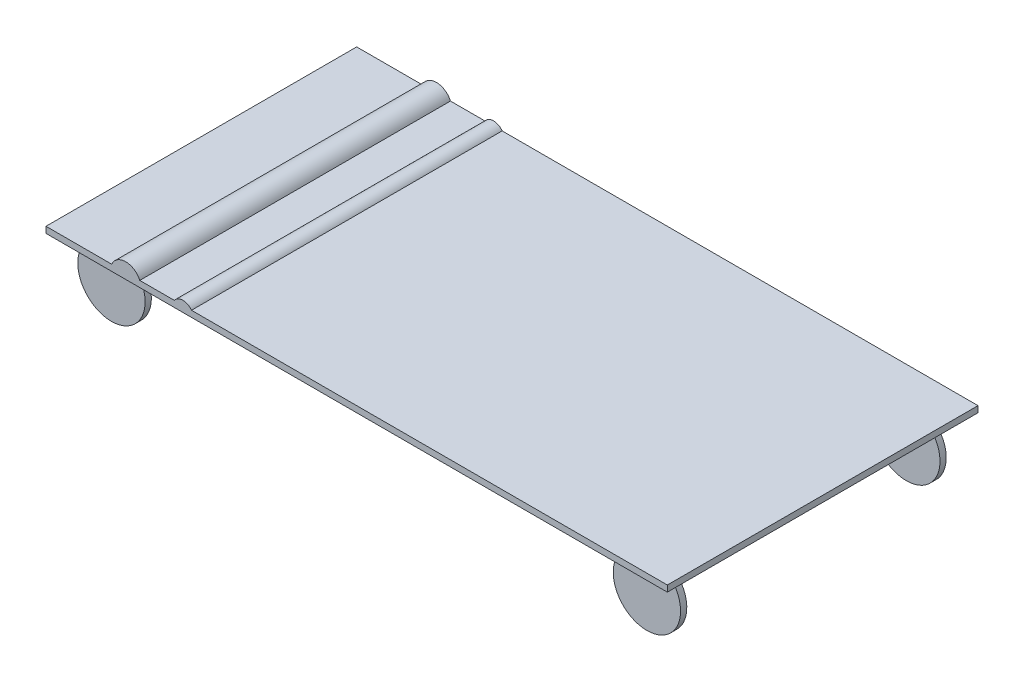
from build123d import *

# Parameters (mm, degrees)
SKETCH1_W                = 5000
SKETCH1_H                = 2500
BOSS_EXTRUDE1_DEPTH      = 50
SKETCH2_R                = 271.031901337
BOSS_EXTRUDE2_DEPTH      = 50
MIRROR2_COPY_1_SKETCH_R  = 271.031901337
MIRROR2_COPY_1_DEPTH     = 50
BOSS_EXTRUDE3_DEPTH      = 1250
BOSS_EXTRUDE3_DEPTH_BACK = 1250


with BuildPart() as part:
    # Sketch1 → Boss-Extrude1 (new body)
    with BuildSketch(Plane(origin=(0, 0, 0), x_dir=(1, 0, 0), z_dir=(0, 1, 0))):
        Rectangle(SKETCH1_W, SKETCH1_H)
    extrude(amount=BOSS_EXTRUDE1_DEPTH)

    # Sketch2 → Boss-Extrude2 (add)
    with BuildSketch(Plane.XY.offset(1018.797385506)):
        with Locations((-2154.495450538, -259.790798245)):
            Circle(SKETCH2_R)
    boss_extrude2 = extrude(amount=BOSS_EXTRUDE2_DEPTH)

    # Mirror1: Boss-Extrude2 across plane
    add(boss_extrude2.mirror(Plane.XY))

    # Mirror2: Boss-Extrude2 across plane
    add(boss_extrude2.mirror(Plane(origin=(0, 0, 0), x_dir=(0, 0, 1), z_dir=(1, 0, 0))))

    # Mirror2 copy 1 sketch → Mirror2 copy 1 (add)
    with BuildSketch(Plane(origin=(0, 0, -1018.797385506), x_dir=(-1, 0, 0), z_dir=(0, 0, -1))):
        with Locations((-2154.495450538, -259.790798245)):
            Circle(MIRROR2_COPY_1_SKETCH_R)
    extrude(amount=MIRROR2_COPY_1_DEPTH)

    # Sketch4 → Boss-Extrude3 (add, two sides: drawn at the far end of the back side and taken through both)
    with BuildSketch(Plane.XY.offset(-BOSS_EXTRUDE3_DEPTH_BACK)):
        with BuildLine():
            Line((-1971.383458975, 50), (-1745.31769207, 50))
            ThreePointArc((-1745.31769207, 50), (-1858.350575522, 123.597867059), (-1971.383458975, 50))
        make_face()
        with BuildLine():
            Line((-1467.150164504, 50), (-1329.043814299, 50))
            ThreePointArc((-1329.043814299, 50), (-1398.096989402, 85.254565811), (-1467.150164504, 50))
        make_face()
    extrude(amount=BOSS_EXTRUDE3_DEPTH + BOSS_EXTRUDE3_DEPTH_BACK)


solid = part.part
